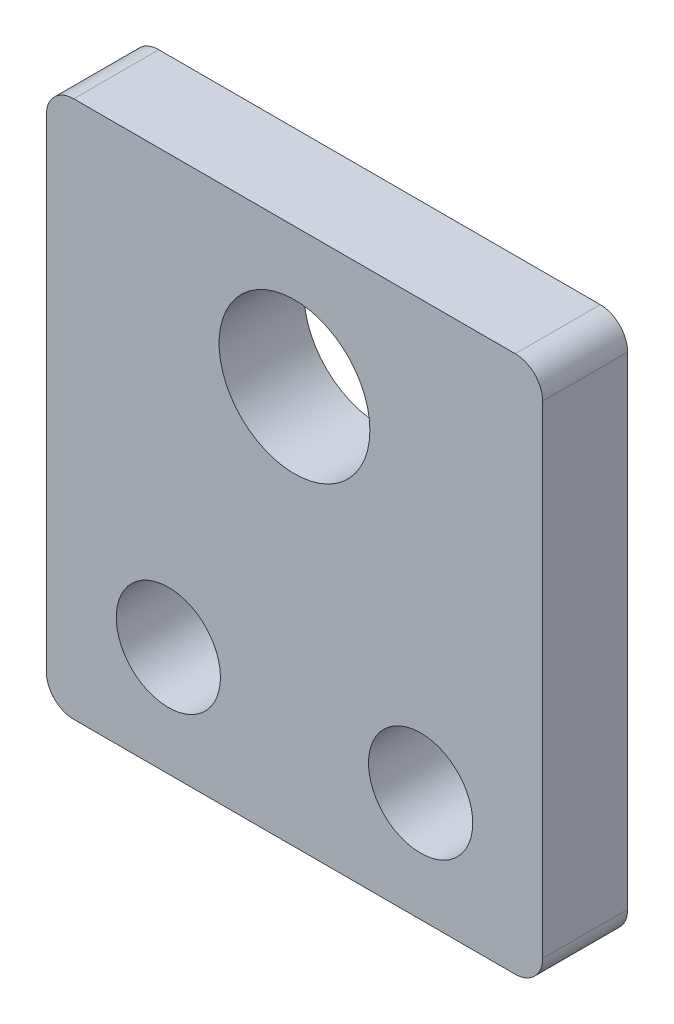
ISO-10303-21;
HEADER;
FILE_DESCRIPTION(('STEP AP214'),'2;1');
FILE_NAME('part.step','',(''),(''),'','','');
FILE_SCHEMA(('AUTOMOTIVE_DESIGN { 1 0 10303 214 1 1 1 1 }'));
ENDSEC;
DATA;
#1=APPLICATION_CONTEXT('core data for automotive mechanical design processes');
#2=APPLICATION_PROTOCOL_DEFINITION('international standard','automotive_design',2000,#1);
#3=PRODUCT_CONTEXT('',#1,'mechanical');
#4=PRODUCT('Part','Part','',(#3));
#5=PRODUCT_RELATED_PRODUCT_CATEGORY('part','',(#4));
#6=PRODUCT_DEFINITION_FORMATION('','',#4);
#7=PRODUCT_DEFINITION_CONTEXT('part definition',#1,'design');
#8=PRODUCT_DEFINITION('design','',#6,#7);
#9=PRODUCT_DEFINITION_SHAPE('','',#8);
#10=(LENGTH_UNIT() NAMED_UNIT(*) SI_UNIT(.MILLI.,.METRE.));
#11=(NAMED_UNIT(*) PLANE_ANGLE_UNIT() SI_UNIT($,.RADIAN.));
#12=(NAMED_UNIT(*) SI_UNIT($,.STERADIAN.) SOLID_ANGLE_UNIT());
#13=UNCERTAINTY_MEASURE_WITH_UNIT(LENGTH_MEASURE(1.E-05),#10,'distance_accuracy_value','');
#14=(GEOMETRIC_REPRESENTATION_CONTEXT(3) GLOBAL_UNCERTAINTY_ASSIGNED_CONTEXT((#13)) GLOBAL_UNIT_ASSIGNED_CONTEXT((#10,
#11,#12)) REPRESENTATION_CONTEXT('',''));
#15=CARTESIAN_POINT('',(0.,0.,0.));
#16=DIRECTION('',(0.,0.,1.));
#17=DIRECTION('',(1.,0.,0.));
#18=AXIS2_PLACEMENT_3D('',#15,#16,#17);
#19=CARTESIAN_POINT('',(0.,0.,7.874));
#20=DIRECTION('',(1.,0.,0.));
#21=DIRECTION('',(0.,0.,-1.));
#22=AXIS2_PLACEMENT_3D('',#19,#20,#21);
#23=PLANE('',#22);
#24=DIRECTION('',(0.,-1.,0.));
#25=VECTOR('',#24,1.);
#26=CARTESIAN_POINT('',(0.,0.,0.));
#27=LINE('',#26,#25);
#28=CARTESIAN_POINT('',(0.,47.244,0.));
#29=VERTEX_POINT('',#28);
#30=CARTESIAN_POINT('',(0.,2.54,0.));
#31=VERTEX_POINT('',#30);
#32=EDGE_CURVE('E146',#29,#31,#27,.T.);
#33=ORIENTED_EDGE('',*,*,#32,.T.);
#34=DIRECTION('',(0.,0.,-1.));
#35=VECTOR('',#34,1.);
#36=CARTESIAN_POINT('',(0.,2.54,7.874));
#37=LINE('',#36,#35);
#38=CARTESIAN_POINT('',(0.,2.54,7.874));
#39=VERTEX_POINT('',#38);
#40=EDGE_CURVE('E169',#31,#39,#37,.F.);
#41=ORIENTED_EDGE('',*,*,#40,.T.);
#42=DIRECTION('',(0.,-1.,0.));
#43=VECTOR('',#42,1.);
#44=CARTESIAN_POINT('',(0.,0.,7.874));
#45=LINE('',#44,#43);
#46=CARTESIAN_POINT('',(0.,47.244,7.874));
#47=VERTEX_POINT('',#46);
#48=EDGE_CURVE('E144',#47,#39,#45,.T.);
#49=ORIENTED_EDGE('',*,*,#48,.F.);
#50=DIRECTION('',(0.,0.,-1.));
#51=VECTOR('',#50,1.);
#52=CARTESIAN_POINT('',(0.,47.244,7.874));
#53=LINE('',#52,#51);
#54=EDGE_CURVE('E166',#47,#29,#53,.T.);
#55=ORIENTED_EDGE('',*,*,#54,.T.);
#56=EDGE_LOOP('',(#33,#41,#49,#55));
#57=FACE_BOUND('',#56,.T.);
#58=ADVANCED_FACE('F51',(#57),#23,.F.);
#59=CARTESIAN_POINT('',(0.,0.,7.874));
#60=DIRECTION('',(0.,1.,0.));
#61=DIRECTION('',(0.,0.,1.));
#62=AXIS2_PLACEMENT_3D('',#59,#60,#61);
#63=PLANE('',#62);
#64=DIRECTION('',(1.,0.,0.));
#65=VECTOR('',#64,1.);
#66=CARTESIAN_POINT('',(0.,0.,0.));
#67=LINE('',#66,#65);
#68=CARTESIAN_POINT('',(2.54,0.,0.));
#69=VERTEX_POINT('',#68);
#70=CARTESIAN_POINT('',(43.434,0.,0.));
#71=VERTEX_POINT('',#70);
#72=EDGE_CURVE('E142',#69,#71,#67,.T.);
#73=ORIENTED_EDGE('',*,*,#72,.T.);
#74=DIRECTION('',(0.,0.,-1.));
#75=VECTOR('',#74,1.);
#76=CARTESIAN_POINT('',(43.434,0.,7.874));
#77=LINE('',#76,#75);
#78=CARTESIAN_POINT('',(43.434,0.,7.874));
#79=VERTEX_POINT('',#78);
#80=EDGE_CURVE('E121',#71,#79,#77,.F.);
#81=ORIENTED_EDGE('',*,*,#80,.T.);
#82=DIRECTION('',(1.,0.,0.));
#83=VECTOR('',#82,1.);
#84=CARTESIAN_POINT('',(0.,0.,7.874));
#85=LINE('',#84,#83);
#86=CARTESIAN_POINT('',(2.54,0.,7.874));
#87=VERTEX_POINT('',#86);
#88=EDGE_CURVE('E185',#87,#79,#85,.T.);
#89=ORIENTED_EDGE('',*,*,#88,.F.);
#90=DIRECTION('',(0.,0.,-1.));
#91=VECTOR('',#90,1.);
#92=CARTESIAN_POINT('',(2.54,0.,7.874));
#93=LINE('',#92,#91);
#94=EDGE_CURVE('E126',#87,#69,#93,.T.);
#95=ORIENTED_EDGE('',*,*,#94,.T.);
#96=EDGE_LOOP('',(#73,#81,#89,#95));
#97=FACE_BOUND('',#96,.T.);
#98=ADVANCED_FACE('F231',(#97),#63,.F.);
#99=CARTESIAN_POINT('',(45.974,0.,7.874));
#100=DIRECTION('',(-1.,0.,0.));
#101=DIRECTION('',(0.,0.,1.));
#102=AXIS2_PLACEMENT_3D('',#99,#100,#101);
#103=PLANE('',#102);
#104=DIRECTION('',(0.,1.,0.));
#105=VECTOR('',#104,1.);
#106=CARTESIAN_POINT('',(45.974,0.,7.874));
#107=LINE('',#106,#105);
#108=CARTESIAN_POINT('',(45.974,2.54,7.874));
#109=VERTEX_POINT('',#108);
#110=CARTESIAN_POINT('',(45.974,47.244,7.874));
#111=VERTEX_POINT('',#110);
#112=EDGE_CURVE('E135',#109,#111,#107,.T.);
#113=ORIENTED_EDGE('',*,*,#112,.F.);
#114=DIRECTION('',(0.,0.,-1.));
#115=VECTOR('',#114,1.);
#116=CARTESIAN_POINT('',(45.974,2.54,7.874));
#117=LINE('',#116,#115);
#118=CARTESIAN_POINT('',(45.974,2.54,0.));
#119=VERTEX_POINT('',#118);
#120=EDGE_CURVE('E120',#109,#119,#117,.T.);
#121=ORIENTED_EDGE('',*,*,#120,.T.);
#122=DIRECTION('',(0.,1.,0.));
#123=VECTOR('',#122,1.);
#124=CARTESIAN_POINT('',(45.974,0.,0.));
#125=LINE('',#124,#123);
#126=CARTESIAN_POINT('',(45.974,47.244,0.));
#127=VERTEX_POINT('',#126);
#128=EDGE_CURVE('E133',#119,#127,#125,.T.);
#129=ORIENTED_EDGE('',*,*,#128,.T.);
#130=DIRECTION('',(0.,0.,-1.));
#131=VECTOR('',#130,1.);
#132=CARTESIAN_POINT('',(45.974,47.244,7.874));
#133=LINE('',#132,#131);
#134=EDGE_CURVE('E137',#127,#111,#133,.F.);
#135=ORIENTED_EDGE('',*,*,#134,.T.);
#136=EDGE_LOOP('',(#113,#121,#129,#135));
#137=FACE_BOUND('',#136,.T.);
#138=ADVANCED_FACE('F132',(#137),#103,.F.);
#139=CARTESIAN_POINT('',(0.,49.784,7.874));
#140=DIRECTION('',(0.,-1.,0.));
#141=DIRECTION('',(0.,0.,-1.));
#142=AXIS2_PLACEMENT_3D('',#139,#140,#141);
#143=PLANE('',#142);
#144=DIRECTION('',(-1.,0.,0.));
#145=VECTOR('',#144,1.);
#146=CARTESIAN_POINT('',(0.,49.784,0.));
#147=LINE('',#146,#145);
#148=CARTESIAN_POINT('',(43.434,49.784,0.));
#149=VERTEX_POINT('',#148);
#150=CARTESIAN_POINT('',(2.54,49.784,0.));
#151=VERTEX_POINT('',#150);
#152=EDGE_CURVE('E141',#149,#151,#147,.T.);
#153=ORIENTED_EDGE('',*,*,#152,.T.);
#154=DIRECTION('',(0.,0.,-1.));
#155=VECTOR('',#154,1.);
#156=CARTESIAN_POINT('',(2.54,49.784,7.874));
#157=LINE('',#156,#155);
#158=CARTESIAN_POINT('',(2.54,49.784,7.874));
#159=VERTEX_POINT('',#158);
#160=EDGE_CURVE('E13',#151,#159,#157,.F.);
#161=ORIENTED_EDGE('',*,*,#160,.T.);
#162=DIRECTION('',(-1.,0.,0.));
#163=VECTOR('',#162,1.);
#164=CARTESIAN_POINT('',(0.,49.784,7.874));
#165=LINE('',#164,#163);
#166=CARTESIAN_POINT('',(43.434,49.784,7.874));
#167=VERTEX_POINT('',#166);
#168=EDGE_CURVE('E150',#167,#159,#165,.T.);
#169=ORIENTED_EDGE('',*,*,#168,.F.);
#170=DIRECTION('',(0.,0.,-1.));
#171=VECTOR('',#170,1.);
#172=CARTESIAN_POINT('',(43.434,49.784,7.874));
#173=LINE('',#172,#171);
#174=EDGE_CURVE('E59',#167,#149,#173,.T.);
#175=ORIENTED_EDGE('',*,*,#174,.T.);
#176=EDGE_LOOP('',(#153,#161,#169,#175));
#177=FACE_BOUND('',#176,.T.);
#178=ADVANCED_FACE('F172',(#177),#143,.F.);
#179=CARTESIAN_POINT('',(0.,0.,7.874));
#180=DIRECTION('',(0.,0.,-1.));
#181=DIRECTION('',(-1.,0.,0.));
#182=AXIS2_PLACEMENT_3D('',#179,#180,#181);
#183=PLANE('',#182);
#184=CARTESIAN_POINT('',(22.987,36.9062,7.874));
#185=DIRECTION('',(0.,0.,1.));
#186=DIRECTION('',(1.,0.,0.));
#187=AXIS2_PLACEMENT_3D('',#184,#185,#186);
#188=CIRCLE('',#187,6.985);
#189=CARTESIAN_POINT('',(29.972,36.9062,7.874));
#190=VERTEX_POINT('',#189);
#191=EDGE_CURVE('E196',#190,#190,#188,.T.);
#192=ORIENTED_EDGE('',*,*,#191,.F.);
#193=EDGE_LOOP('',(#192));
#194=FACE_BOUND('',#193,.T.);
#195=CARTESIAN_POINT('',(34.671,10.16,7.874));
#196=DIRECTION('',(0.,0.,1.));
#197=DIRECTION('',(1.,0.,0.));
#198=AXIS2_PLACEMENT_3D('',#195,#196,#197);
#199=CIRCLE('',#198,4.826);
#200=CARTESIAN_POINT('',(39.497,10.16,7.874));
#201=VERTEX_POINT('',#200);
#202=EDGE_CURVE('E201',#201,#201,#199,.T.);
#203=ORIENTED_EDGE('',*,*,#202,.F.);
#204=EDGE_LOOP('',(#203));
#205=FACE_BOUND('',#204,.T.);
#206=CARTESIAN_POINT('',(11.303,10.16,7.874));
#207=DIRECTION('',(0.,0.,1.));
#208=DIRECTION('',(1.,0.,0.));
#209=AXIS2_PLACEMENT_3D('',#206,#207,#208);
#210=CIRCLE('',#209,4.826);
#211=CARTESIAN_POINT('',(16.129,10.16,7.874));
#212=VERTEX_POINT('',#211);
#213=EDGE_CURVE('E208',#212,#212,#210,.T.);
#214=ORIENTED_EDGE('',*,*,#213,.F.);
#215=EDGE_LOOP('',(#214));
#216=FACE_BOUND('',#215,.T.);
#217=ORIENTED_EDGE('',*,*,#88,.T.);
#218=CARTESIAN_POINT('',(43.434,2.54,7.874));
#219=DIRECTION('',(0.,0.,-1.));
#220=DIRECTION('',(-1.,0.,0.));
#221=AXIS2_PLACEMENT_3D('',#218,#219,#220);
#222=CIRCLE('',#221,2.54);
#223=EDGE_CURVE('E164',#79,#109,#222,.F.);
#224=ORIENTED_EDGE('',*,*,#223,.T.);
#225=ORIENTED_EDGE('',*,*,#112,.T.);
#226=CARTESIAN_POINT('',(43.434,47.244,7.874));
#227=DIRECTION('',(0.,0.,-1.));
#228=DIRECTION('',(-1.,0.,0.));
#229=AXIS2_PLACEMENT_3D('',#226,#227,#228);
#230=CIRCLE('',#229,2.54);
#231=EDGE_CURVE('E71',#111,#167,#230,.F.);
#232=ORIENTED_EDGE('',*,*,#231,.T.);
#233=ORIENTED_EDGE('',*,*,#168,.T.);
#234=CARTESIAN_POINT('',(2.54,47.244,7.874));
#235=DIRECTION('',(0.,0.,-1.));
#236=DIRECTION('',(-1.,0.,0.));
#237=AXIS2_PLACEMENT_3D('',#234,#235,#236);
#238=CIRCLE('',#237,2.54);
#239=EDGE_CURVE('E160',#159,#47,#238,.F.);
#240=ORIENTED_EDGE('',*,*,#239,.T.);
#241=ORIENTED_EDGE('',*,*,#48,.T.);
#242=CARTESIAN_POINT('',(2.54,2.54,7.874));
#243=DIRECTION('',(0.,0.,-1.));
#244=DIRECTION('',(-1.,0.,0.));
#245=AXIS2_PLACEMENT_3D('',#242,#243,#244);
#246=CIRCLE('',#245,2.54);
#247=EDGE_CURVE('E162',#39,#87,#246,.F.);
#248=ORIENTED_EDGE('',*,*,#247,.T.);
#249=EDGE_LOOP('',(#217,#224,#225,#232,#233,#240,#241,#248));
#250=FACE_BOUND('',#249,.T.);
#251=ADVANCED_FACE('F227',(#194,#205,#216,#250),#183,.F.);
#252=CARTESIAN_POINT('',(0.,0.,0.));
#253=DIRECTION('',(0.,0.,-1.));
#254=DIRECTION('',(-1.,0.,0.));
#255=AXIS2_PLACEMENT_3D('',#252,#253,#254);
#256=PLANE('',#255);
#257=CARTESIAN_POINT('',(22.987,36.9062,0.));
#258=DIRECTION('',(0.,0.,1.));
#259=DIRECTION('',(1.,0.,0.));
#260=AXIS2_PLACEMENT_3D('',#257,#258,#259);
#261=CIRCLE('',#260,6.985);
#262=CARTESIAN_POINT('',(29.972,36.9062,0.));
#263=VERTEX_POINT('',#262);
#264=EDGE_CURVE('E194',#263,#263,#261,.T.);
#265=ORIENTED_EDGE('',*,*,#264,.T.);
#266=EDGE_LOOP('',(#265));
#267=FACE_BOUND('',#266,.T.);
#268=CARTESIAN_POINT('',(34.671,10.16,0.));
#269=DIRECTION('',(0.,0.,1.));
#270=DIRECTION('',(1.,0.,0.));
#271=AXIS2_PLACEMENT_3D('',#268,#269,#270);
#272=CIRCLE('',#271,4.826);
#273=CARTESIAN_POINT('',(39.497,10.16,0.));
#274=VERTEX_POINT('',#273);
#275=EDGE_CURVE('E206',#274,#274,#272,.T.);
#276=ORIENTED_EDGE('',*,*,#275,.T.);
#277=EDGE_LOOP('',(#276));
#278=FACE_BOUND('',#277,.T.);
#279=CARTESIAN_POINT('',(11.303,10.16,0.));
#280=DIRECTION('',(0.,0.,1.));
#281=DIRECTION('',(1.,0.,0.));
#282=AXIS2_PLACEMENT_3D('',#279,#280,#281);
#283=CIRCLE('',#282,4.826);
#284=CARTESIAN_POINT('',(16.129,10.16,0.));
#285=VERTEX_POINT('',#284);
#286=EDGE_CURVE('E190',#285,#285,#283,.T.);
#287=ORIENTED_EDGE('',*,*,#286,.T.);
#288=EDGE_LOOP('',(#287));
#289=FACE_BOUND('',#288,.T.);
#290=ORIENTED_EDGE('',*,*,#128,.F.);
#291=CARTESIAN_POINT('',(43.434,2.54,0.));
#292=DIRECTION('',(0.,0.,-1.));
#293=DIRECTION('',(-1.,0.,0.));
#294=AXIS2_PLACEMENT_3D('',#291,#292,#293);
#295=CIRCLE('',#294,2.54);
#296=EDGE_CURVE('E116',#119,#71,#295,.T.);
#297=ORIENTED_EDGE('',*,*,#296,.T.);
#298=ORIENTED_EDGE('',*,*,#72,.F.);
#299=CARTESIAN_POINT('',(2.54,2.54,0.));
#300=DIRECTION('',(0.,0.,-1.));
#301=DIRECTION('',(-1.,0.,0.));
#302=AXIS2_PLACEMENT_3D('',#299,#300,#301);
#303=CIRCLE('',#302,2.54);
#304=EDGE_CURVE('E127',#69,#31,#303,.T.);
#305=ORIENTED_EDGE('',*,*,#304,.T.);
#306=ORIENTED_EDGE('',*,*,#32,.F.);
#307=CARTESIAN_POINT('',(2.54,47.244,0.));
#308=DIRECTION('',(0.,0.,-1.));
#309=DIRECTION('',(-1.,0.,0.));
#310=AXIS2_PLACEMENT_3D('',#307,#308,#309);
#311=CIRCLE('',#310,2.54);
#312=EDGE_CURVE('E153',#29,#151,#311,.T.);
#313=ORIENTED_EDGE('',*,*,#312,.T.);
#314=ORIENTED_EDGE('',*,*,#152,.F.);
#315=CARTESIAN_POINT('',(43.434,47.244,0.));
#316=DIRECTION('',(0.,0.,-1.));
#317=DIRECTION('',(-1.,0.,0.));
#318=AXIS2_PLACEMENT_3D('',#315,#316,#317);
#319=CIRCLE('',#318,2.54);
#320=EDGE_CURVE('E136',#149,#127,#319,.T.);
#321=ORIENTED_EDGE('',*,*,#320,.T.);
#322=EDGE_LOOP('',(#290,#297,#298,#305,#306,#313,#314,#321));
#323=FACE_BOUND('',#322,.T.);
#324=ADVANCED_FACE('F139',(#267,#278,#289,#323),#256,.T.);
#325=CARTESIAN_POINT('',(11.303,10.16,0.));
#326=DIRECTION('',(0.,0.,1.));
#327=DIRECTION('',(1.,0.,0.));
#328=AXIS2_PLACEMENT_3D('',#325,#326,#327);
#329=CYLINDRICAL_SURFACE('',#328,4.826);
#330=ORIENTED_EDGE('',*,*,#286,.F.);
#331=EDGE_LOOP('',(#330));
#332=FACE_BOUND('',#331,.T.);
#333=ORIENTED_EDGE('',*,*,#213,.T.);
#334=EDGE_LOOP('',(#333));
#335=FACE_BOUND('',#334,.T.);
#336=ADVANCED_FACE('F216',(#332,#335),#329,.F.);
#337=CARTESIAN_POINT('',(34.671,10.16,0.));
#338=DIRECTION('',(0.,0.,1.));
#339=DIRECTION('',(1.,0.,0.));
#340=AXIS2_PLACEMENT_3D('',#337,#338,#339);
#341=CYLINDRICAL_SURFACE('',#340,4.826);
#342=ORIENTED_EDGE('',*,*,#275,.F.);
#343=EDGE_LOOP('',(#342));
#344=FACE_BOUND('',#343,.T.);
#345=ORIENTED_EDGE('',*,*,#202,.T.);
#346=EDGE_LOOP('',(#345));
#347=FACE_BOUND('',#346,.T.);
#348=ADVANCED_FACE('F218',(#344,#347),#341,.F.);
#349=CARTESIAN_POINT('',(22.987,36.9062,0.));
#350=DIRECTION('',(0.,0.,1.));
#351=DIRECTION('',(1.,0.,0.));
#352=AXIS2_PLACEMENT_3D('',#349,#350,#351);
#353=CYLINDRICAL_SURFACE('',#352,6.985);
#354=ORIENTED_EDGE('',*,*,#264,.F.);
#355=EDGE_LOOP('',(#354));
#356=FACE_BOUND('',#355,.T.);
#357=ORIENTED_EDGE('',*,*,#191,.T.);
#358=EDGE_LOOP('',(#357));
#359=FACE_BOUND('',#358,.T.);
#360=ADVANCED_FACE('F224',(#356,#359),#353,.F.);
#361=CARTESIAN_POINT('',(43.434,2.54,7.874));
#362=DIRECTION('',(0.,0.,-1.));
#363=DIRECTION('',(-1.,0.,0.));
#364=AXIS2_PLACEMENT_3D('',#361,#362,#363);
#365=CYLINDRICAL_SURFACE('',#364,2.54);
#366=ORIENTED_EDGE('',*,*,#223,.F.);
#367=ORIENTED_EDGE('',*,*,#80,.F.);
#368=ORIENTED_EDGE('',*,*,#296,.F.);
#369=ORIENTED_EDGE('',*,*,#120,.F.);
#370=EDGE_LOOP('',(#366,#367,#368,#369));
#371=FACE_BOUND('',#370,.T.);
#372=ADVANCED_FACE('F119',(#371),#365,.T.);
#373=CARTESIAN_POINT('',(2.54,2.54,7.874));
#374=DIRECTION('',(0.,0.,-1.));
#375=DIRECTION('',(-1.,0.,0.));
#376=AXIS2_PLACEMENT_3D('',#373,#374,#375);
#377=CYLINDRICAL_SURFACE('',#376,2.54);
#378=ORIENTED_EDGE('',*,*,#247,.F.);
#379=ORIENTED_EDGE('',*,*,#40,.F.);
#380=ORIENTED_EDGE('',*,*,#304,.F.);
#381=ORIENTED_EDGE('',*,*,#94,.F.);
#382=EDGE_LOOP('',(#378,#379,#380,#381));
#383=FACE_BOUND('',#382,.T.);
#384=ADVANCED_FACE('F242',(#383),#377,.T.);
#385=CARTESIAN_POINT('',(2.54,47.244,7.874));
#386=DIRECTION('',(0.,0.,-1.));
#387=DIRECTION('',(-1.,0.,0.));
#388=AXIS2_PLACEMENT_3D('',#385,#386,#387);
#389=CYLINDRICAL_SURFACE('',#388,2.54);
#390=ORIENTED_EDGE('',*,*,#239,.F.);
#391=ORIENTED_EDGE('',*,*,#160,.F.);
#392=ORIENTED_EDGE('',*,*,#312,.F.);
#393=ORIENTED_EDGE('',*,*,#54,.F.);
#394=EDGE_LOOP('',(#390,#391,#392,#393));
#395=FACE_BOUND('',#394,.T.);
#396=ADVANCED_FACE('F179',(#395),#389,.T.);
#397=CARTESIAN_POINT('',(43.434,47.244,7.874));
#398=DIRECTION('',(0.,0.,-1.));
#399=DIRECTION('',(-1.,0.,0.));
#400=AXIS2_PLACEMENT_3D('',#397,#398,#399);
#401=CYLINDRICAL_SURFACE('',#400,2.54);
#402=ORIENTED_EDGE('',*,*,#231,.F.);
#403=ORIENTED_EDGE('',*,*,#134,.F.);
#404=ORIENTED_EDGE('',*,*,#320,.F.);
#405=ORIENTED_EDGE('',*,*,#174,.F.);
#406=EDGE_LOOP('',(#402,#403,#404,#405));
#407=FACE_BOUND('',#406,.T.);
#408=ADVANCED_FACE('F53',(#407),#401,.T.);
#409=CLOSED_SHELL('',(#58,#98,#138,#178,#251,#324,#336,#348,#360,#372,#384,#396,#408));
#410=MANIFOLD_SOLID_BREP('B2',#409);
#411=ADVANCED_BREP_SHAPE_REPRESENTATION('',(#18,#410),#14);
#412=SHAPE_DEFINITION_REPRESENTATION(#9,#411);
ENDSEC;
END-ISO-10303-21;
